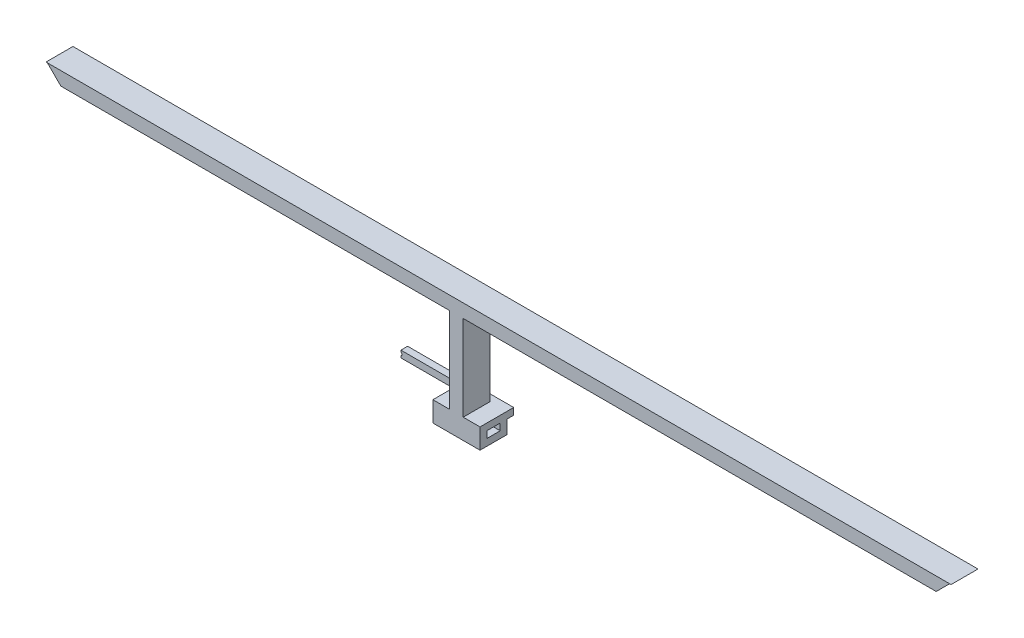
from build123d import *

# Parameters (mm, degrees)
ESQUISSE1_W             = 40
ESQUISSE1_H             = 30
ESQUISSE1_W_2           = 20
ESQUISSE1_H_2           = 10
BASE_EXTRUSION_DEPTH    = 35
ESQUISSE2_W             = 20
ESQUISSE2_H             = 40
BOSS_EXTRU_1_DEPTH      = 127
BOSS_EXTRU_2_DEPTH      = 734.483
BOSS_EXTRU_2_DEPTH_BACK = 609.517
ESQUISSE3_W             = 40
ESQUISSE3_H             = 20
ENL_V_MAT_EXTRU_1_DEPTH = 753.139799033
BOSS_EXTRU_3_DEPTH      = 10


with BuildPart() as part:
    # Esquisse1 → Base-Extrusion (new, symmetric)
    with BuildSketch(Plane(origin=(0, 0, 0), x_dir=(0, 0, -1), z_dir=(1, 0, 0))):
        with Locations((0, -5)):
            Rectangle(ESQUISSE1_W, ESQUISSE1_H)
        with Locations((0, -5)):
            Rectangle(ESQUISSE1_W_2, ESQUISSE1_H_2, mode=Mode.SUBTRACT)
    extrude(amount=BASE_EXTRUSION_DEPTH, both=True)

    # Esquisse2 → Boss.-Extru.1 (add)
    with BuildSketch(Plane(origin=(0, 10, 0), x_dir=(-1, 0, 0), z_dir=(0, 1, 0))):
        Rectangle(ESQUISSE2_W, ESQUISSE2_H)
    extrude(amount=BOSS_EXTRU_1_DEPTH)

    # Esquisse3 → Boss.-Extru.2 (add, two sides: drawn at the far end of the back side and taken through both)
    with BuildSketch(Plane(origin=(0, 0, 0), x_dir=(0, 0, -1), z_dir=(1, 0, 0)).offset(-BOSS_EXTRU_2_DEPTH_BACK)):
        with Locations((0, 147)):
            Rectangle(ESQUISSE3_W, ESQUISSE3_H)
    extrude(amount=BOSS_EXTRU_2_DEPTH + BOSS_EXTRU_2_DEPTH_BACK)

    # Esquisse4 → Enl_v. mat.-Extru.1 (cut, through all)
    with BuildSketch(Plane.XY.offset(20)):
        with BuildLine():
            Line((730.947466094, 155.535533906), (712.411932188, 137))
            Line((712.411932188, 137), (734.483, 137))
            Line((734.483, 137), (734.483, 157))
            ThreePointArc((734.483, 157), (732.569582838, 156.619397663), (730.947466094, 155.535533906))
        make_face()
        with BuildLine():
            Line((-587.445932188, 137), (-609.517, 137))
            Line((-609.517, 137), (-609.517, 157))
            ThreePointArc((-609.517, 157), (-607.603582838, 156.619397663), (-605.981466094, 155.535533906))
            Line((-605.981466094, 155.535533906), (-587.445932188, 137))
        make_face()
    extrude(amount=-ENL_V_MAT_EXTRU_1_DEPTH, mode=Mode.SUBTRACT)

    # Esquisse5 → Boss.-Extru.3 (add)
    with BuildSketch(Plane(origin=(0, 0, -20), x_dir=(-1, 0, 0), z_dir=(0, 0, -1))):
        with BuildLine():
            Line((122.517, 7), (122.517, 10))
            Line((122.517, 10), (-35, 10))
            Line((-35, 10), (-35, 0))
            Line((-35, 0), (122.517, 0))
            Line((122.517, 0), (122.517, 3))
            ThreePointArc((122.517, 3), (120.517, 5), (122.517, 7))
        make_face()
    extrude(amount=BOSS_EXTRU_3_DEPTH)


solid = part.part
